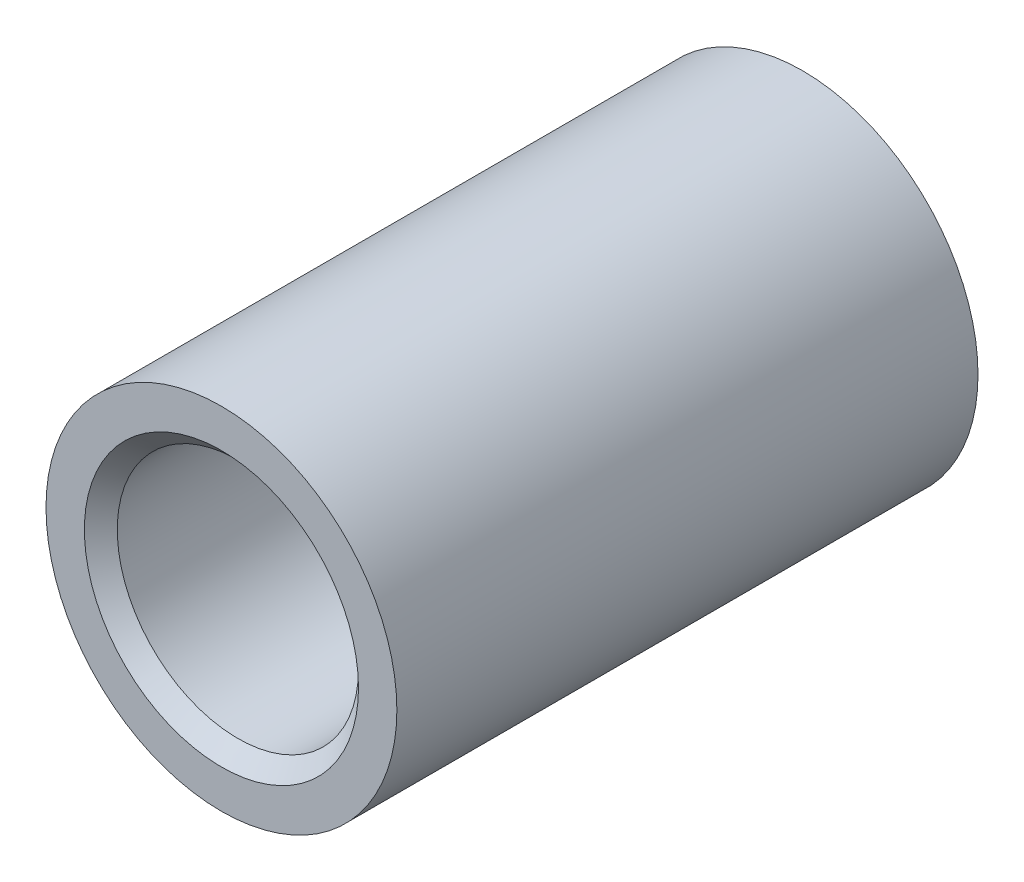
from build123d import *

# Parameters (mm, degrees)
IZIM2_R                     = 16
IZIM2_R_2                   = 11
Y_KSEKLIK_EKSTR_ZYON1_DEPTH = 53
PAH2_SIZE                   = 1.5


with BuildPart() as part:
    # izim2 → Y_kseklik-Ekstr_zyon1 (new body)
    with BuildSketch(Plane.XY):
        Circle(IZIM2_R)
        Circle(IZIM2_R_2, mode=Mode.SUBTRACT)
    extrude(amount=Y_KSEKLIK_EKSTR_ZYON1_DEPTH)

    # Pah2
    pah2_edges = [part.edges().sort_by_distance(p)[0] for p in [
        (-11, 0, 0),
        (-11, 0, 53),
    ]]
    chamfer(pah2_edges, length=PAH2_SIZE)


solid = part.part
